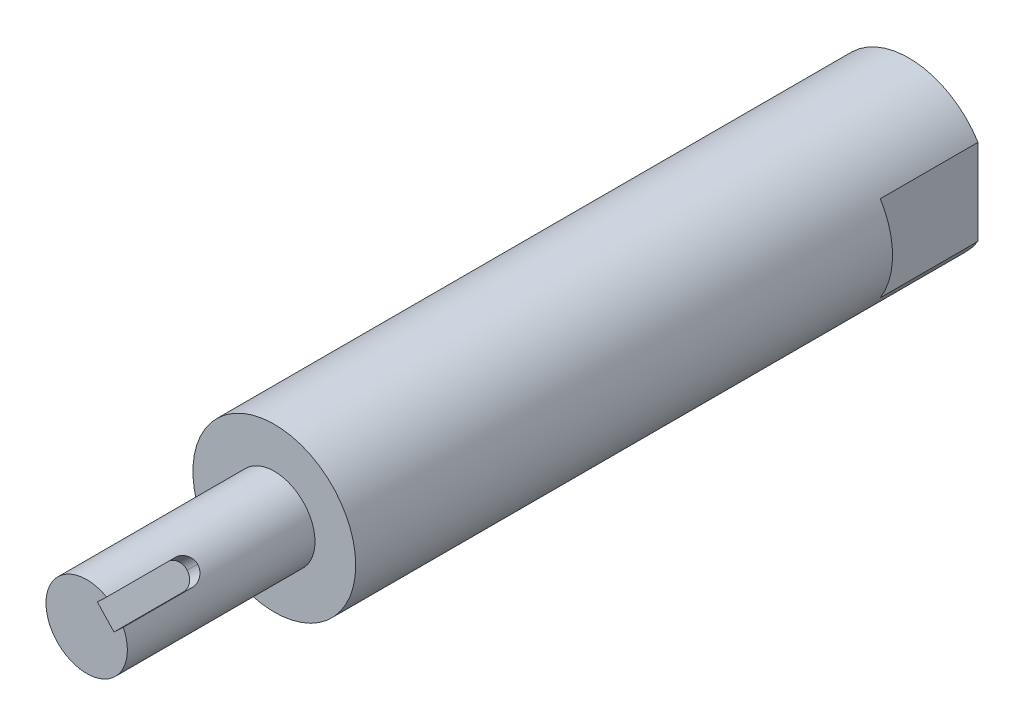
ISO-10303-21;
HEADER;
FILE_DESCRIPTION(('STEP AP214'),'2;1');
FILE_NAME('part.step','',(''),(''),'','','');
FILE_SCHEMA(('AUTOMOTIVE_DESIGN { 1 0 10303 214 1 1 1 1 }'));
ENDSEC;
DATA;
#1=APPLICATION_CONTEXT('core data for automotive mechanical design processes');
#2=APPLICATION_PROTOCOL_DEFINITION('international standard','automotive_design',2000,#1);
#3=PRODUCT_CONTEXT('',#1,'mechanical');
#4=PRODUCT('Part','Part','',(#3));
#5=PRODUCT_RELATED_PRODUCT_CATEGORY('part','',(#4));
#6=PRODUCT_DEFINITION_FORMATION('','',#4);
#7=PRODUCT_DEFINITION_CONTEXT('part definition',#1,'design');
#8=PRODUCT_DEFINITION('design','',#6,#7);
#9=PRODUCT_DEFINITION_SHAPE('','',#8);
#10=(LENGTH_UNIT() NAMED_UNIT(*) SI_UNIT(.MILLI.,.METRE.));
#11=(NAMED_UNIT(*) PLANE_ANGLE_UNIT() SI_UNIT($,.RADIAN.));
#12=(NAMED_UNIT(*) SI_UNIT($,.STERADIAN.) SOLID_ANGLE_UNIT());
#13=UNCERTAINTY_MEASURE_WITH_UNIT(LENGTH_MEASURE(1.E-05),#10,'distance_accuracy_value','');
#14=(GEOMETRIC_REPRESENTATION_CONTEXT(3) GLOBAL_UNCERTAINTY_ASSIGNED_CONTEXT((#13)) GLOBAL_UNIT_ASSIGNED_CONTEXT((#10,
#11,#12)) REPRESENTATION_CONTEXT('',''));
#15=CARTESIAN_POINT('',(0.,0.,0.));
#16=DIRECTION('',(0.,0.,1.));
#17=DIRECTION('',(1.,0.,0.));
#18=AXIS2_PLACEMENT_3D('',#15,#16,#17);
#19=CARTESIAN_POINT('',(0.,0.,66.95));
#20=DIRECTION('',(0.,0.,-1.));
#21=DIRECTION('',(-1.,0.,0.));
#22=AXIS2_PLACEMENT_3D('',#19,#20,#21);
#23=CYLINDRICAL_SURFACE('',#22,10.);
#24=CARTESIAN_POINT('',(0.,0.,66.95));
#25=DIRECTION('',(0.,0.,1.));
#26=DIRECTION('',(1.,0.,0.));
#27=AXIS2_PLACEMENT_3D('',#24,#25,#26);
#28=CIRCLE('',#27,10.);
#29=CARTESIAN_POINT('',(10.,0.,66.95));
#30=VERTEX_POINT('',#29);
#31=EDGE_CURVE('E124',#30,#30,#28,.T.);
#32=ORIENTED_EDGE('',*,*,#31,.F.);
#33=EDGE_LOOP('',(#32));
#34=FACE_BOUND('',#33,.T.);
#35=CARTESIAN_POINT('',(0.,0.,1.));
#36=DIRECTION('',(0.,0.,1.));
#37=DIRECTION('',(1.,0.,0.));
#38=AXIS2_PLACEMENT_3D('',#35,#36,#37);
#39=CIRCLE('',#38,10.);
#40=CARTESIAN_POINT('',(-8.5,5.26782687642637,1.));
#41=VERTEX_POINT('',#40);
#42=CARTESIAN_POINT('',(-8.5,-5.26782687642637,1.));
#43=VERTEX_POINT('',#42);
#44=EDGE_CURVE('E11',#41,#43,#39,.T.);
#45=ORIENTED_EDGE('',*,*,#44,.T.);
#46=DIRECTION('',(0.,0.,-1.));
#47=VECTOR('',#46,1.);
#48=CARTESIAN_POINT('',(-8.5,-5.26782687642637,66.95));
#49=LINE('',#48,#47);
#50=CARTESIAN_POINT('',(-8.5,-5.26782687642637,-11.));
#51=VERTEX_POINT('',#50);
#52=EDGE_CURVE('E111',#43,#51,#49,.T.);
#53=ORIENTED_EDGE('',*,*,#52,.T.);
#54=CARTESIAN_POINT('',(0.,0.,-11.));
#55=DIRECTION('',(0.,0.,1.));
#56=DIRECTION('',(1.,0.,0.));
#57=AXIS2_PLACEMENT_3D('',#54,#55,#56);
#58=CIRCLE('',#57,10.);
#59=CARTESIAN_POINT('',(8.5,-5.26782687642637,-11.));
#60=VERTEX_POINT('',#59);
#61=EDGE_CURVE('E40',#51,#60,#58,.T.);
#62=ORIENTED_EDGE('',*,*,#61,.T.);
#63=DIRECTION('',(0.,0.,-1.));
#64=VECTOR('',#63,1.);
#65=CARTESIAN_POINT('',(8.5,-5.26782687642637,66.95));
#66=LINE('',#65,#64);
#67=CARTESIAN_POINT('',(8.5,-5.26782687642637,1.));
#68=VERTEX_POINT('',#67);
#69=EDGE_CURVE('E116',#60,#68,#66,.F.);
#70=ORIENTED_EDGE('',*,*,#69,.T.);
#71=CARTESIAN_POINT('',(0.,0.,1.));
#72=DIRECTION('',(0.,0.,1.));
#73=DIRECTION('',(1.,0.,0.));
#74=AXIS2_PLACEMENT_3D('',#71,#72,#73);
#75=CIRCLE('',#74,10.);
#76=CARTESIAN_POINT('',(8.5,5.26782687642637,1.));
#77=VERTEX_POINT('',#76);
#78=EDGE_CURVE('E238',#68,#77,#75,.T.);
#79=ORIENTED_EDGE('',*,*,#78,.T.);
#80=DIRECTION('',(0.,0.,-1.));
#81=VECTOR('',#80,1.);
#82=CARTESIAN_POINT('',(8.5,5.26782687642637,66.95));
#83=LINE('',#82,#81);
#84=CARTESIAN_POINT('',(8.5,5.26782687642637,-11.));
#85=VERTEX_POINT('',#84);
#86=EDGE_CURVE('E118',#77,#85,#83,.T.);
#87=ORIENTED_EDGE('',*,*,#86,.T.);
#88=CARTESIAN_POINT('',(-8.5,5.26782687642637,-11.));
#89=VERTEX_POINT('',#88);
#90=EDGE_CURVE('E121',#85,#89,#58,.T.);
#91=ORIENTED_EDGE('',*,*,#90,.T.);
#92=DIRECTION('',(0.,0.,-1.));
#93=VECTOR('',#92,1.);
#94=CARTESIAN_POINT('',(-8.5,5.26782687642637,66.95));
#95=LINE('',#94,#93);
#96=EDGE_CURVE('E32',#89,#41,#95,.F.);
#97=ORIENTED_EDGE('',*,*,#96,.T.);
#98=EDGE_LOOP('',(#45,#53,#62,#70,#79,#87,#91,#97));
#99=FACE_BOUND('',#98,.T.);
#100=ADVANCED_FACE('F16',(#34,#99),#23,.T.);
#101=CARTESIAN_POINT('',(0.,0.,66.95));
#102=DIRECTION('',(0.,0.,1.));
#103=DIRECTION('',(1.,0.,0.));
#104=AXIS2_PLACEMENT_3D('',#101,#102,#103);
#105=PLANE('',#104);
#106=CARTESIAN_POINT('',(0.,0.,66.95));
#107=DIRECTION('',(0.,0.,1.));
#108=DIRECTION('',(1.,0.,0.));
#109=AXIS2_PLACEMENT_3D('',#106,#107,#108);
#110=CIRCLE('',#109,5.);
#111=CARTESIAN_POINT('',(5.,0.,66.95));
#112=VERTEX_POINT('',#111);
#113=EDGE_CURVE('E233',#112,#112,#110,.F.);
#114=ORIENTED_EDGE('',*,*,#113,.T.);
#115=EDGE_LOOP('',(#114));
#116=FACE_BOUND('',#115,.T.);
#117=ORIENTED_EDGE('',*,*,#31,.T.);
#118=EDGE_LOOP('',(#117));
#119=FACE_BOUND('',#118,.T.);
#120=ADVANCED_FACE('F197',(#116,#119),#105,.T.);
#121=CARTESIAN_POINT('',(1.30310664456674,3.28510472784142,80.));
#122=DIRECTION('',(-0.728390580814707,-0.685162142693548,0.));
#123=DIRECTION('',(0.685162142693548,-0.728390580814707,0.));
#124=AXIS2_PLACEMENT_3D('',#121,#122,#123);
#125=PLANE('',#124);
#126=CARTESIAN_POINT('',(2.33084985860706,2.19251885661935,81.5));
#127=DIRECTION('',(-0.728390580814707,-0.685162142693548,0.));
#128=DIRECTION('',(0.685162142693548,-0.728390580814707,0.));
#129=AXIS2_PLACEMENT_3D('',#126,#127,#128);
#130=CIRCLE('',#129,1.5);
#131=CARTESIAN_POINT('',(3.35859307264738,1.0999329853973,81.5));
#132=VERTEX_POINT('',#131);
#133=CARTESIAN_POINT('',(2.33084985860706,2.19251885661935,80.));
#134=VERTEX_POINT('',#133);
#135=EDGE_CURVE('E148',#132,#134,#130,.F.);
#136=ORIENTED_EDGE('',*,*,#135,.T.);
#137=CARTESIAN_POINT('',(2.33084985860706,2.19251885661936,81.5));
#138=DIRECTION('',(-0.728390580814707,-0.685162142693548,0.));
#139=DIRECTION('',(0.685162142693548,-0.728390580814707,0.));
#140=AXIS2_PLACEMENT_3D('',#137,#138,#139);
#141=CIRCLE('',#140,1.5);
#142=CARTESIAN_POINT('',(1.30310664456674,3.28510472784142,81.5));
#143=VERTEX_POINT('',#142);
#144=EDGE_CURVE('E150',#134,#143,#141,.F.);
#145=ORIENTED_EDGE('',*,*,#144,.T.);
#146=DIRECTION('',(0.,0.,1.));
#147=VECTOR('',#146,1.);
#148=CARTESIAN_POINT('',(1.30310664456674,3.28510472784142,80.));
#149=LINE('',#148,#147);
#150=CARTESIAN_POINT('',(1.30310664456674,3.28510472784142,90.));
#151=VERTEX_POINT('',#150);
#152=EDGE_CURVE('E133',#143,#151,#149,.T.);
#153=ORIENTED_EDGE('',*,*,#152,.T.);
#154=DIRECTION('',(0.685162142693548,-0.728390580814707,0.));
#155=VECTOR('',#154,1.);
#156=CARTESIAN_POINT('',(1.30310664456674,3.28510472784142,90.));
#157=LINE('',#156,#155);
#158=CARTESIAN_POINT('',(3.35859307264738,1.0999329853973,90.));
#159=VERTEX_POINT('',#158);
#160=EDGE_CURVE('E128',#151,#159,#157,.T.);
#161=ORIENTED_EDGE('',*,*,#160,.T.);
#162=DIRECTION('',(0.,0.,1.));
#163=VECTOR('',#162,1.);
#164=CARTESIAN_POINT('',(3.35859307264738,1.0999329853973,80.));
#165=LINE('',#164,#163);
#166=EDGE_CURVE('E134',#132,#159,#165,.T.);
#167=ORIENTED_EDGE('',*,*,#166,.F.);
#168=EDGE_LOOP('',(#136,#145,#153,#161,#167));
#169=FACE_BOUND('',#168,.T.);
#170=ADVANCED_FACE('F205',(#169),#125,.F.);
#171=CARTESIAN_POINT('',(0.,0.,81.5));
#172=DIRECTION('',(0.728390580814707,0.685162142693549,0.));
#173=DIRECTION('',(-0.685162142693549,0.728390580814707,0.));
#174=AXIS2_PLACEMENT_3D('',#171,#172,#173);
#175=CYLINDRICAL_SURFACE('',#174,1.5);
#176=DIRECTION('',(0.728390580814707,0.685162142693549,0.));
#177=VECTOR('',#176,1.);
#178=CARTESIAN_POINT('',(3.35859307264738,1.0999329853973,81.5));
#179=LINE('',#178,#177);
#180=CARTESIAN_POINT('',(4.50194485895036,2.17542926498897,81.5));
#181=VERTEX_POINT('',#180);
#182=EDGE_CURVE('E155',#181,#132,#179,.F.);
#183=ORIENTED_EDGE('',*,*,#182,.F.);
#184=CARTESIAN_POINT('',(3.64195290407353,3.42581071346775,80.));
#185=CARTESIAN_POINT('',(3.67019941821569,3.39578611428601,79.9999992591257));
#186=CARTESIAN_POINT('',(3.698055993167,3.3654229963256,80.001700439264));
#187=CARTESIAN_POINT('',(3.7528254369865,3.30423710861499,80.0084804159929));
#188=CARTESIAN_POINT('',(3.77973849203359,3.27341443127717,80.0135585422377));
#189=CARTESIAN_POINT('',(3.85865823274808,3.18077045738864,80.0337751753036));
#190=CARTESIAN_POINT('',(3.90903516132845,3.11857100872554,80.0538963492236));
#191=CARTESIAN_POINT('',(4.00422055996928,2.99537893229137,80.1067428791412));
#192=CARTESIAN_POINT('',(4.04903022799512,2.93438604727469,80.1394655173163));
#193=CARTESIAN_POINT('',(4.13252260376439,2.81558728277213,80.2165230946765));
#194=CARTESIAN_POINT('',(4.17120271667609,2.75778275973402,80.2608629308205));
#195=CARTESIAN_POINT('',(4.24303863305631,2.64597016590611,80.3612215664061));
#196=CARTESIAN_POINT('',(4.27602720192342,2.59209758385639,80.4175108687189));
#197=CARTESIAN_POINT('',(4.33519311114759,2.49188557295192,80.5396036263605));
#198=CARTESIAN_POINT('',(4.36136867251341,2.44554811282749,80.6054095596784));
#199=CARTESIAN_POINT('',(4.40750033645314,2.36141951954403,80.7464938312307));
#200=CARTESIAN_POINT('',(4.42730106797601,2.32384727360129,80.8219538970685));
#201=CARTESIAN_POINT('',(4.4599570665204,2.2605439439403,80.9790548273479));
#202=CARTESIAN_POINT('',(4.47281887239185,2.23480171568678,81.060689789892));
#203=CARTESIAN_POINT('',(4.48883616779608,2.20240199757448,81.2022679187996));
#204=CARTESIAN_POINT('',(4.49375423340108,2.19232084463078,81.261253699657));
#205=CARTESIAN_POINT('',(4.50030582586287,2.17882130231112,81.3801473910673));
#206=CARTESIAN_POINT('',(4.50194008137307,2.17540143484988,81.4400550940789));
#207=CARTESIAN_POINT('',(4.50194485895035,2.17542926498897,81.5));
#208=B_SPLINE_CURVE_WITH_KNOTS('',3,(#184,#185,#186,#187,#188,#189,#190,#191,#192,#193,#194,
#195,#196,#197,#198,#199,#200,#201,#202,#203,#204,#205,#206,#207),.UNSPECIFIED.,.F.,.F.,(4,2,2,
2,2,2,2,2,2,2,2,4),(0.,0.123590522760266,0.247156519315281,0.49346772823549,0.739725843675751,
0.986087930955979,1.23877207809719,1.49152213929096,1.7500335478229,2.00830092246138,
2.18798745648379,2.36763411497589),.UNSPECIFIED.);
#209=CARTESIAN_POINT('',(3.64195290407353,3.42581071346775,80.));
#210=VERTEX_POINT('',#209);
#211=EDGE_CURVE('E164',#210,#181,#208,.T.);
#212=ORIENTED_EDGE('',*,*,#211,.F.);
#213=DIRECTION('',(0.728390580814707,0.685162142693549,0.));
#214=VECTOR('',#213,1.);
#215=CARTESIAN_POINT('',(0.,0.,80.));
#216=LINE('',#215,#214);
#217=EDGE_CURVE('E127',#134,#210,#216,.T.);
#218=ORIENTED_EDGE('',*,*,#217,.F.);
#219=ORIENTED_EDGE('',*,*,#135,.F.);
#220=EDGE_LOOP('',(#183,#212,#218,#219));
#221=FACE_BOUND('',#220,.T.);
#222=ADVANCED_FACE('F18',(#221),#175,.F.);
#223=CARTESIAN_POINT('',(0.,0.,81.5));
#224=DIRECTION('',(-0.728390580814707,-0.685162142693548,0.));
#225=DIRECTION('',(0.685162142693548,-0.728390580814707,0.));
#226=AXIS2_PLACEMENT_3D('',#223,#224,#225);
#227=CYLINDRICAL_SURFACE('',#226,1.5);
#228=CARTESIAN_POINT('',(2.4464584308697,4.36060100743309,81.5));
#229=CARTESIAN_POINT('',(2.44645528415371,4.36059921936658,81.4588191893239));
#230=CARTESIAN_POINT('',(2.44801007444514,4.35973084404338,81.4176591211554));
#231=CARTESIAN_POINT('',(2.45419073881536,4.35625603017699,81.3356532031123));
#232=CARTESIAN_POINT('',(2.45881592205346,4.35364998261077,81.2948072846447));
#233=CARTESIAN_POINT('',(2.47718827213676,4.34324160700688,81.1734039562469));
#234=CARTESIAN_POINT('',(2.49543290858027,4.33284906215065,81.0936909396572));
#235=CARTESIAN_POINT('',(2.5429069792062,4.30515598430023,80.9389657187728));
#236=CARTESIAN_POINT('',(2.57213276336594,4.28785774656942,80.8639519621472));
#237=CARTESIAN_POINT('',(2.6401193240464,4.24633396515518,80.7204056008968));
#238=CARTESIAN_POINT('',(2.6788848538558,4.2221049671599,80.6518762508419));
#239=CARTESIAN_POINT('',(2.76544748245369,4.16593694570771,80.5211348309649));
#240=CARTESIAN_POINT('',(2.81347021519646,4.13379812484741,80.4591580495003));
#241=CARTESIAN_POINT('',(2.91578342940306,4.06227731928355,80.345365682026));
#242=CARTESIAN_POINT('',(2.97007513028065,4.02289392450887,80.2935520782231));
#243=CARTESIAN_POINT('',(3.08400529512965,3.93625880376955,80.2005222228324));
#244=CARTESIAN_POINT('',(3.14373203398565,3.88885934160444,80.159551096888));
#245=CARTESIAN_POINT('',(3.26518585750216,3.7874530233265,80.0909932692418));
#246=CARTESIAN_POINT('',(3.32691115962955,3.73345194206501,80.0633949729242));
#247=CARTESIAN_POINT('',(3.43135625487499,3.63719675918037,80.0287310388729));
#248=CARTESIAN_POINT('',(3.47417190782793,3.59633639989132,80.0179786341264));
#249=CARTESIAN_POINT('',(3.55890613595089,3.5125181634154,80.0036059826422));
#250=CARTESIAN_POINT('',(3.60082501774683,3.46956102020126,79.9999832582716));
#251=CARTESIAN_POINT('',(3.64195290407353,3.42581071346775,80.));
#252=B_SPLINE_CURVE_WITH_KNOTS('',3,(#228,#229,#230,#231,#232,#233,#234,#235,#236,#237,#238,
#239,#240,#241,#242,#243,#244,#245,#246,#247,#248,#249,#250,#251),.UNSPECIFIED.,.F.,.F.,(4,2,2,
2,2,2,2,2,2,2,2,4),(0.,0.123463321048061,0.246898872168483,0.49291137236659,0.7388421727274,
0.984895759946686,1.23795183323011,1.49105721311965,1.74947248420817,2.00766329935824,
2.18768027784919,2.36763468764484),.UNSPECIFIED.);
#253=CARTESIAN_POINT('',(2.4464584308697,4.36060100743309,81.5));
#254=VERTEX_POINT('',#253);
#255=EDGE_CURVE('E157',#254,#210,#252,.T.);
#256=ORIENTED_EDGE('',*,*,#255,.F.);
#257=DIRECTION('',(-0.728390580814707,-0.685162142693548,0.));
#258=VECTOR('',#257,1.);
#259=CARTESIAN_POINT('',(4.34896118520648,6.15019425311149,81.5));
#260=LINE('',#259,#258);
#261=EDGE_CURVE('E152',#143,#254,#260,.F.);
#262=ORIENTED_EDGE('',*,*,#261,.F.);
#263=ORIENTED_EDGE('',*,*,#144,.F.);
#264=ORIENTED_EDGE('',*,*,#217,.T.);
#265=EDGE_LOOP('',(#256,#262,#263,#264));
#266=FACE_BOUND('',#265,.T.);
#267=ADVANCED_FACE('F170',(#266),#227,.F.);
#268=CARTESIAN_POINT('',(4.34896118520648,6.15019425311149,80.));
#269=DIRECTION('',(-0.685162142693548,0.728390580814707,0.));
#270=DIRECTION('',(-0.728390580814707,-0.685162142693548,0.));
#271=AXIS2_PLACEMENT_3D('',#268,#269,#270);
#272=PLANE('',#271);
#273=ORIENTED_EDGE('',*,*,#152,.F.);
#274=ORIENTED_EDGE('',*,*,#261,.T.);
#275=DIRECTION('',(0.,0.,1.));
#276=VECTOR('',#275,1.);
#277=CARTESIAN_POINT('',(2.4464584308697,4.36060100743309,60.));
#278=LINE('',#277,#276);
#279=CARTESIAN_POINT('',(2.4464584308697,4.36060100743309,90.));
#280=VERTEX_POINT('',#279);
#281=EDGE_CURVE('E136',#254,#280,#278,.T.);
#282=ORIENTED_EDGE('',*,*,#281,.T.);
#283=DIRECTION('',(-0.728390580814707,-0.685162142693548,0.));
#284=VECTOR('',#283,1.);
#285=CARTESIAN_POINT('',(-1.02774321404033,1.09258587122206,90.));
#286=LINE('',#285,#284);
#287=EDGE_CURVE('E145',#280,#151,#286,.T.);
#288=ORIENTED_EDGE('',*,*,#287,.T.);
#289=EDGE_LOOP('',(#273,#274,#282,#288));
#290=FACE_BOUND('',#289,.T.);
#291=ADVANCED_FACE('F180',(#290),#272,.F.);
#292=CARTESIAN_POINT('',(0.,0.,90.));
#293=DIRECTION('',(0.,0.,1.));
#294=DIRECTION('',(1.,0.,0.));
#295=AXIS2_PLACEMENT_3D('',#292,#293,#294);
#296=PLANE('',#295);
#297=DIRECTION('',(0.728390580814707,0.685162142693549,0.));
#298=VECTOR('',#297,1.);
#299=CARTESIAN_POINT('',(3.35859307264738,1.0999329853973,90.));
#300=LINE('',#299,#298);
#301=CARTESIAN_POINT('',(4.50194485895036,2.17542926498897,90.));
#302=VERTEX_POINT('',#301);
#303=EDGE_CURVE('E131',#159,#302,#300,.T.);
#304=ORIENTED_EDGE('',*,*,#303,.F.);
#305=ORIENTED_EDGE('',*,*,#160,.F.);
#306=ORIENTED_EDGE('',*,*,#287,.F.);
#307=CARTESIAN_POINT('',(0.,0.,90.));
#308=DIRECTION('',(0.,0.,1.));
#309=DIRECTION('',(1.,0.,0.));
#310=AXIS2_PLACEMENT_3D('',#307,#308,#309);
#311=CIRCLE('',#310,5.);
#312=EDGE_CURVE('E142',#280,#302,#311,.T.);
#313=ORIENTED_EDGE('',*,*,#312,.T.);
#314=EDGE_LOOP('',(#304,#305,#306,#313));
#315=FACE_BOUND('',#314,.T.);
#316=ADVANCED_FACE('F182',(#315),#296,.T.);
#317=CARTESIAN_POINT('',(3.35859307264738,1.0999329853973,80.));
#318=DIRECTION('',(0.685162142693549,-0.728390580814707,0.));
#319=DIRECTION('',(0.728390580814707,0.685162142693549,0.));
#320=AXIS2_PLACEMENT_3D('',#317,#318,#319);
#321=PLANE('',#320);
#322=DIRECTION('',(0.,0.,1.));
#323=VECTOR('',#322,1.);
#324=CARTESIAN_POINT('',(4.50194485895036,2.17542926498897,60.));
#325=LINE('',#324,#323);
#326=EDGE_CURVE('E139',#302,#181,#325,.F.);
#327=ORIENTED_EDGE('',*,*,#326,.T.);
#328=ORIENTED_EDGE('',*,*,#182,.T.);
#329=ORIENTED_EDGE('',*,*,#166,.T.);
#330=ORIENTED_EDGE('',*,*,#303,.T.);
#331=EDGE_LOOP('',(#327,#328,#329,#330));
#332=FACE_BOUND('',#331,.T.);
#333=ADVANCED_FACE('F178',(#332),#321,.F.);
#334=CARTESIAN_POINT('',(0.,0.,60.));
#335=DIRECTION('',(0.,0.,1.));
#336=DIRECTION('',(1.,0.,0.));
#337=AXIS2_PLACEMENT_3D('',#334,#335,#336);
#338=CYLINDRICAL_SURFACE('',#337,5.);
#339=ORIENTED_EDGE('',*,*,#113,.F.);
#340=EDGE_LOOP('',(#339));
#341=FACE_BOUND('',#340,.T.);
#342=ORIENTED_EDGE('',*,*,#326,.F.);
#343=ORIENTED_EDGE('',*,*,#312,.F.);
#344=ORIENTED_EDGE('',*,*,#281,.F.);
#345=ORIENTED_EDGE('',*,*,#255,.T.);
#346=ORIENTED_EDGE('',*,*,#211,.T.);
#347=EDGE_LOOP('',(#342,#343,#344,#345,#346));
#348=FACE_BOUND('',#347,.T.);
#349=ADVANCED_FACE('F173',(#341,#348),#338,.T.);
#350=CARTESIAN_POINT('',(0.,0.,-11.));
#351=DIRECTION('',(0.,0.,-1.));
#352=DIRECTION('',(-1.,0.,0.));
#353=AXIS2_PLACEMENT_3D('',#350,#351,#352);
#354=PLANE('',#353);
#355=CARTESIAN_POINT('',(0.,0.,-11.));
#356=DIRECTION('',(0.,0.,-1.));
#357=DIRECTION('',(-1.,0.,0.));
#358=AXIS2_PLACEMENT_3D('',#355,#356,#357);
#359=CIRCLE('',#358,6.);
#360=CARTESIAN_POINT('',(-6.,0.,-11.));
#361=VERTEX_POINT('',#360);
#362=EDGE_CURVE('E103',#361,#361,#359,.T.);
#363=ORIENTED_EDGE('',*,*,#362,.F.);
#364=EDGE_LOOP('',(#363));
#365=FACE_BOUND('',#364,.T.);
#366=DIRECTION('',(0.,-1.,0.));
#367=VECTOR('',#366,1.);
#368=CARTESIAN_POINT('',(-8.5,0.,-11.));
#369=LINE('',#368,#367);
#370=EDGE_CURVE('E25',#89,#51,#369,.T.);
#371=ORIENTED_EDGE('',*,*,#370,.F.);
#372=ORIENTED_EDGE('',*,*,#90,.F.);
#373=DIRECTION('',(0.,1.,0.));
#374=VECTOR('',#373,1.);
#375=CARTESIAN_POINT('',(8.5,0.,-11.));
#376=LINE('',#375,#374);
#377=EDGE_CURVE('E235',#60,#85,#376,.T.);
#378=ORIENTED_EDGE('',*,*,#377,.F.);
#379=ORIENTED_EDGE('',*,*,#61,.F.);
#380=EDGE_LOOP('',(#371,#372,#378,#379));
#381=FACE_BOUND('',#380,.T.);
#382=ADVANCED_FACE('F177',(#365,#381),#354,.T.);
#383=CARTESIAN_POINT('',(0.,0.,1.));
#384=DIRECTION('',(0.,0.,1.));
#385=DIRECTION('',(1.,0.,0.));
#386=AXIS2_PLACEMENT_3D('',#383,#384,#385);
#387=PLANE('',#386);
#388=DIRECTION('',(0.,1.,0.));
#389=VECTOR('',#388,1.);
#390=CARTESIAN_POINT('',(8.5,7.97308057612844,1.));
#391=LINE('',#390,#389);
#392=EDGE_CURVE('E113',#68,#77,#391,.T.);
#393=ORIENTED_EDGE('',*,*,#392,.T.);
#394=ORIENTED_EDGE('',*,*,#78,.F.);
#395=EDGE_LOOP('',(#393,#394));
#396=FACE_BOUND('',#395,.T.);
#397=ADVANCED_FACE('F249',(#396),#387,.F.);
#398=CARTESIAN_POINT('',(8.5,7.97308057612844,1.));
#399=DIRECTION('',(-1.,0.,0.));
#400=DIRECTION('',(0.,-1.,0.));
#401=AXIS2_PLACEMENT_3D('',#398,#399,#400);
#402=PLANE('',#401);
#403=ORIENTED_EDGE('',*,*,#392,.F.);
#404=ORIENTED_EDGE('',*,*,#69,.F.);
#405=ORIENTED_EDGE('',*,*,#377,.T.);
#406=ORIENTED_EDGE('',*,*,#86,.F.);
#407=EDGE_LOOP('',(#403,#404,#405,#406));
#408=FACE_BOUND('',#407,.T.);
#409=ADVANCED_FACE('F247',(#408),#402,.F.);
#410=CARTESIAN_POINT('',(0.,0.,1.));
#411=DIRECTION('',(0.,0.,1.));
#412=DIRECTION('',(1.,0.,0.));
#413=AXIS2_PLACEMENT_3D('',#410,#411,#412);
#414=PLANE('',#413);
#415=DIRECTION('',(0.,-1.,0.));
#416=VECTOR('',#415,1.);
#417=CARTESIAN_POINT('',(-8.5,7.97308057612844,1.));
#418=LINE('',#417,#416);
#419=EDGE_CURVE('E102',#41,#43,#418,.T.);
#420=ORIENTED_EDGE('',*,*,#419,.T.);
#421=ORIENTED_EDGE('',*,*,#44,.F.);
#422=EDGE_LOOP('',(#420,#421));
#423=FACE_BOUND('',#422,.T.);
#424=ADVANCED_FACE('F257',(#423),#414,.F.);
#425=CARTESIAN_POINT('',(-8.5,7.97308057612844,1.));
#426=DIRECTION('',(1.,0.,0.));
#427=DIRECTION('',(0.,1.,0.));
#428=AXIS2_PLACEMENT_3D('',#425,#426,#427);
#429=PLANE('',#428);
#430=ORIENTED_EDGE('',*,*,#419,.F.);
#431=ORIENTED_EDGE('',*,*,#96,.F.);
#432=ORIENTED_EDGE('',*,*,#370,.T.);
#433=ORIENTED_EDGE('',*,*,#52,.F.);
#434=EDGE_LOOP('',(#430,#431,#432,#433));
#435=FACE_BOUND('',#434,.T.);
#436=ADVANCED_FACE('F96',(#435),#429,.F.);
#437=CARTESIAN_POINT('',(0.,0.,7.));
#438=DIRECTION('',(0.,0.,-1.));
#439=DIRECTION('',(-1.,0.,0.));
#440=AXIS2_PLACEMENT_3D('',#437,#438,#439);
#441=CONICAL_SURFACE('',#440,6.,1.02974425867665);
#442=CARTESIAN_POINT('',(0.,0.,10.6051637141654));
#443=VERTEX_POINT('',#442);
#444=VERTEX_LOOP('',#443);
#445=FACE_BOUND('',#444,.T.);
#446=CARTESIAN_POINT('',(0.,0.,7.));
#447=DIRECTION('',(0.,0.,-1.));
#448=DIRECTION('',(-1.,0.,0.));
#449=AXIS2_PLACEMENT_3D('',#446,#447,#448);
#450=CIRCLE('',#449,6.);
#451=CARTESIAN_POINT('',(-6.,0.,7.));
#452=VERTEX_POINT('',#451);
#453=EDGE_CURVE('E100',#452,#452,#450,.T.);
#454=ORIENTED_EDGE('',*,*,#453,.T.);
#455=EDGE_LOOP('',(#454));
#456=FACE_BOUND('',#455,.T.);
#457=ADVANCED_FACE('F92',(#445,#456),#441,.F.);
#458=CARTESIAN_POINT('',(0.,0.,-11.));
#459=DIRECTION('',(0.,0.,-1.));
#460=DIRECTION('',(-1.,0.,0.));
#461=AXIS2_PLACEMENT_3D('',#458,#459,#460);
#462=CYLINDRICAL_SURFACE('',#461,6.);
#463=ORIENTED_EDGE('',*,*,#453,.F.);
#464=EDGE_LOOP('',(#463));
#465=FACE_BOUND('',#464,.T.);
#466=ORIENTED_EDGE('',*,*,#362,.T.);
#467=EDGE_LOOP('',(#466));
#468=FACE_BOUND('',#467,.T.);
#469=ADVANCED_FACE('F95',(#465,#468),#462,.F.);
#470=CLOSED_SHELL('',(#100,#120,#170,#222,#267,#291,#316,#333,#349,#382,#397,#409,#424,#436,
#457,#469));
#471=MANIFOLD_SOLID_BREP('B1',#470);
#472=ADVANCED_BREP_SHAPE_REPRESENTATION('',(#18,#471),#14);
#473=SHAPE_DEFINITION_REPRESENTATION(#9,#472);
ENDSEC;
END-ISO-10303-21;
